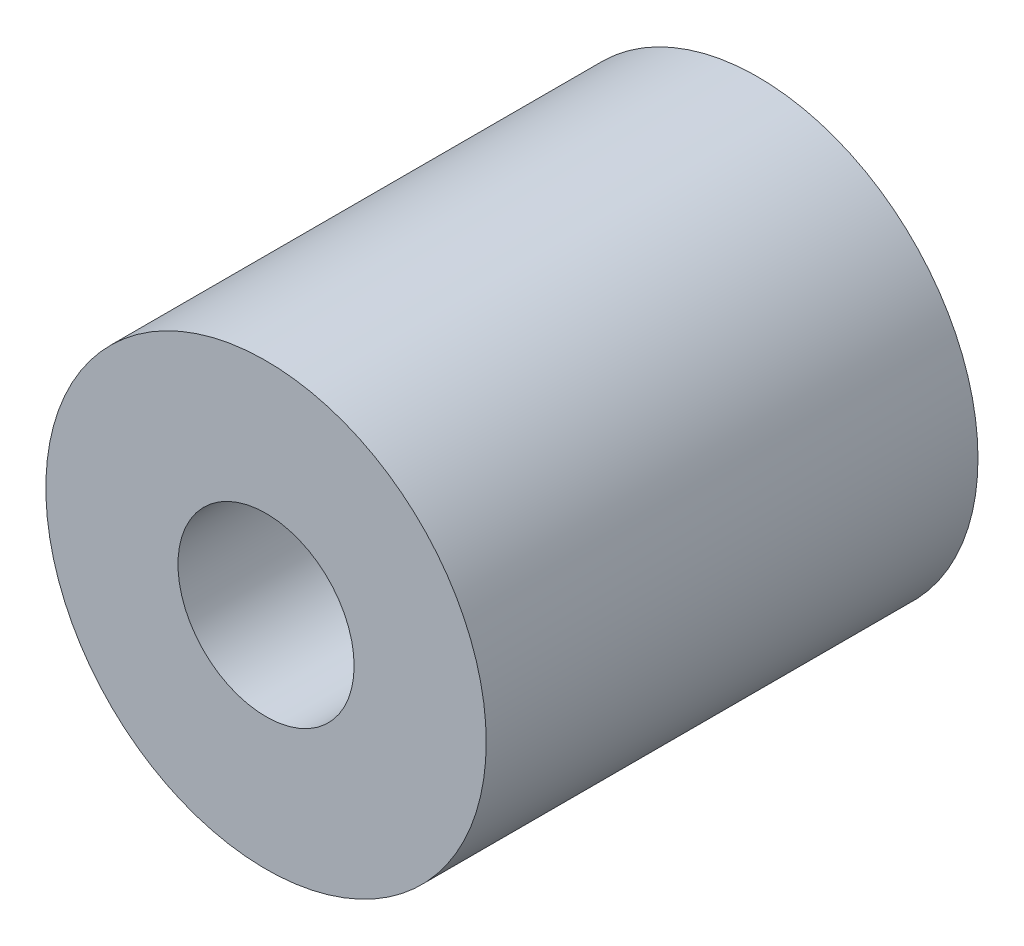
ISO-10303-21;
HEADER;
FILE_DESCRIPTION(('STEP AP214'),'2;1');
FILE_NAME('part.step','',(''),(''),'','','');
FILE_SCHEMA(('AUTOMOTIVE_DESIGN { 1 0 10303 214 1 1 1 1 }'));
ENDSEC;
DATA;
#1=APPLICATION_CONTEXT('core data for automotive mechanical design processes');
#2=APPLICATION_PROTOCOL_DEFINITION('international standard','automotive_design',2000,#1);
#3=PRODUCT_CONTEXT('',#1,'mechanical');
#4=PRODUCT('Part','Part','',(#3));
#5=PRODUCT_RELATED_PRODUCT_CATEGORY('part','',(#4));
#6=PRODUCT_DEFINITION_FORMATION('','',#4);
#7=PRODUCT_DEFINITION_CONTEXT('part definition',#1,'design');
#8=PRODUCT_DEFINITION('design','',#6,#7);
#9=PRODUCT_DEFINITION_SHAPE('','',#8);
#10=(LENGTH_UNIT() NAMED_UNIT(*) SI_UNIT(.MILLI.,.METRE.));
#11=(NAMED_UNIT(*) PLANE_ANGLE_UNIT() SI_UNIT($,.RADIAN.));
#12=(NAMED_UNIT(*) SI_UNIT($,.STERADIAN.) SOLID_ANGLE_UNIT());
#13=UNCERTAINTY_MEASURE_WITH_UNIT(LENGTH_MEASURE(1.E-05),#10,'distance_accuracy_value','');
#14=(GEOMETRIC_REPRESENTATION_CONTEXT(3) GLOBAL_UNCERTAINTY_ASSIGNED_CONTEXT((#13)) GLOBAL_UNIT_ASSIGNED_CONTEXT((#10,
#11,#12)) REPRESENTATION_CONTEXT('',''));
#15=CARTESIAN_POINT('',(0.,0.,0.));
#16=DIRECTION('',(0.,0.,1.));
#17=DIRECTION('',(1.,0.,0.));
#18=AXIS2_PLACEMENT_3D('',#15,#16,#17);
#19=CARTESIAN_POINT('',(0.,0.,33.5));
#20=DIRECTION('',(0.,0.,1.));
#21=DIRECTION('',(1.,0.,0.));
#22=AXIS2_PLACEMENT_3D('',#19,#20,#21);
#23=PLANE('',#22);
#24=CARTESIAN_POINT('',(0.,0.,33.5));
#25=DIRECTION('',(0.,0.,1.));
#26=DIRECTION('',(1.,0.,0.));
#27=AXIS2_PLACEMENT_3D('',#24,#25,#26);
#28=CIRCLE('',#27,15.);
#29=CARTESIAN_POINT('',(15.,0.,33.5));
#30=VERTEX_POINT('',#29);
#31=EDGE_CURVE('E10',#30,#30,#28,.T.);
#32=ORIENTED_EDGE('',*,*,#31,.T.);
#33=EDGE_LOOP('',(#32));
#34=FACE_BOUND('',#33,.T.);
#35=CARTESIAN_POINT('',(0.,0.,33.5));
#36=DIRECTION('',(0.,0.,1.));
#37=DIRECTION('',(1.,0.,0.));
#38=AXIS2_PLACEMENT_3D('',#35,#36,#37);
#39=CIRCLE('',#38,6.);
#40=CARTESIAN_POINT('',(6.,0.,33.5));
#41=VERTEX_POINT('',#40);
#42=EDGE_CURVE('E60',#41,#41,#39,.T.);
#43=ORIENTED_EDGE('',*,*,#42,.F.);
#44=EDGE_LOOP('',(#43));
#45=FACE_BOUND('',#44,.T.);
#46=ADVANCED_FACE('F46',(#34,#45),#23,.T.);
#47=CARTESIAN_POINT('',(0.,0.,0.));
#48=DIRECTION('',(0.,0.,1.));
#49=DIRECTION('',(1.,0.,0.));
#50=AXIS2_PLACEMENT_3D('',#47,#48,#49);
#51=PLANE('',#50);
#52=CARTESIAN_POINT('',(0.,0.,0.));
#53=DIRECTION('',(0.,0.,1.));
#54=DIRECTION('',(1.,0.,0.));
#55=AXIS2_PLACEMENT_3D('',#52,#53,#54);
#56=CIRCLE('',#55,15.);
#57=CARTESIAN_POINT('',(15.,0.,0.));
#58=VERTEX_POINT('',#57);
#59=EDGE_CURVE('E50',#58,#58,#56,.T.);
#60=ORIENTED_EDGE('',*,*,#59,.F.);
#61=EDGE_LOOP('',(#60));
#62=FACE_BOUND('',#61,.T.);
#63=CARTESIAN_POINT('',(0.,0.,0.));
#64=DIRECTION('',(0.,0.,1.));
#65=DIRECTION('',(1.,0.,0.));
#66=AXIS2_PLACEMENT_3D('',#63,#64,#65);
#67=CIRCLE('',#66,6.);
#68=CARTESIAN_POINT('',(6.,0.,0.));
#69=VERTEX_POINT('',#68);
#70=EDGE_CURVE('E62',#69,#69,#67,.T.);
#71=ORIENTED_EDGE('',*,*,#70,.T.);
#72=EDGE_LOOP('',(#71));
#73=FACE_BOUND('',#72,.T.);
#74=ADVANCED_FACE('F75',(#62,#73),#51,.F.);
#75=CARTESIAN_POINT('',(0.,0.,33.5));
#76=DIRECTION('',(0.,0.,-1.));
#77=DIRECTION('',(-1.,0.,0.));
#78=AXIS2_PLACEMENT_3D('',#75,#76,#77);
#79=CYLINDRICAL_SURFACE('',#78,15.);
#80=ORIENTED_EDGE('',*,*,#31,.F.);
#81=EDGE_LOOP('',(#80));
#82=FACE_BOUND('',#81,.T.);
#83=ORIENTED_EDGE('',*,*,#59,.T.);
#84=EDGE_LOOP('',(#83));
#85=FACE_BOUND('',#84,.T.);
#86=ADVANCED_FACE('F48',(#82,#85),#79,.T.);
#87=CARTESIAN_POINT('',(0.,0.,33.5));
#88=DIRECTION('',(0.,0.,-1.));
#89=DIRECTION('',(-1.,0.,0.));
#90=AXIS2_PLACEMENT_3D('',#87,#88,#89);
#91=CYLINDRICAL_SURFACE('',#90,6.);
#92=ORIENTED_EDGE('',*,*,#42,.T.);
#93=EDGE_LOOP('',(#92));
#94=FACE_BOUND('',#93,.T.);
#95=ORIENTED_EDGE('',*,*,#70,.F.);
#96=EDGE_LOOP('',(#95));
#97=FACE_BOUND('',#96,.T.);
#98=ADVANCED_FACE('F71',(#94,#97),#91,.F.);
#99=CLOSED_SHELL('',(#46,#74,#86,#98));
#100=MANIFOLD_SOLID_BREP('B2',#99);
#101=ADVANCED_BREP_SHAPE_REPRESENTATION('',(#18,#100),#14);
#102=SHAPE_DEFINITION_REPRESENTATION(#9,#101);
ENDSEC;
END-ISO-10303-21;
